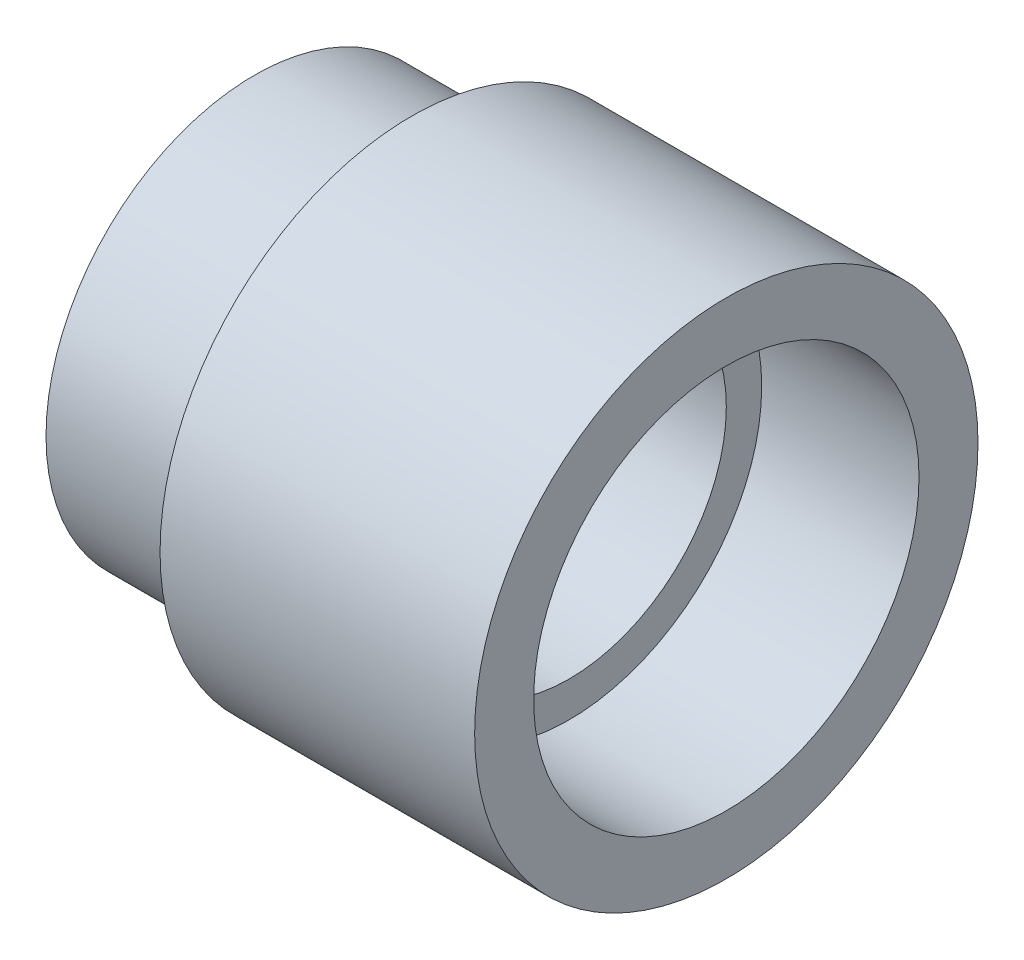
from build123d import *

# Parameters (mm, degrees)
ESQUISSE1_W                                    = 30
ESQUISSE1_H                                    = 6
ESQUISSE2_R                                    = 16
ESQUISSE2_R_2                                  = 13.25
FILETAGE_NEZ_DE_ROBINET_DIAMETRE_26_5_G3_DEPTH = 10
ESQUISSE3_R                                    = 12.25
ENL_V_MAT_EXTRU_1_DEPTH                        = 10


with BuildPart() as part:
    # Esquisse1 → R_volution1 (revolve)
    with BuildSketch(Plane.XY, mode=Mode.PRIVATE) as r_volution1_sk:
        with Locations((15, 13)):
            Rectangle(ESQUISSE1_W, ESQUISSE1_H)
    revolve(r_volution1_sk.sketch.rotate(Axis((-73.509412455, 0, 0), (1, 0, 0)), 90), axis=Axis((-73.509412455, 0, 0), (1, 0, 0)))

    # Esquisse2 → filetage-nez de robinet diametre 26.5-G3 (cut)
    with BuildSketch(Plane.ZY):
        Circle(ESQUISSE2_R)
        Circle(ESQUISSE2_R_2, mode=Mode.SUBTRACT)
    extrude(amount=-FILETAGE_NEZ_DE_ROBINET_DIAMETRE_26_5_G3_DEPTH, mode=Mode.SUBTRACT)

    # Esquisse3 → Enl_v. mat.-Extru.1 (cut)
    with BuildSketch(Plane(origin=(30, 0, 0), x_dir=(0, 0, -1), z_dir=(1, 0, 0))):
        Circle(ESQUISSE3_R)
    extrude(amount=-ENL_V_MAT_EXTRU_1_DEPTH, mode=Mode.SUBTRACT)


solid = part.part
